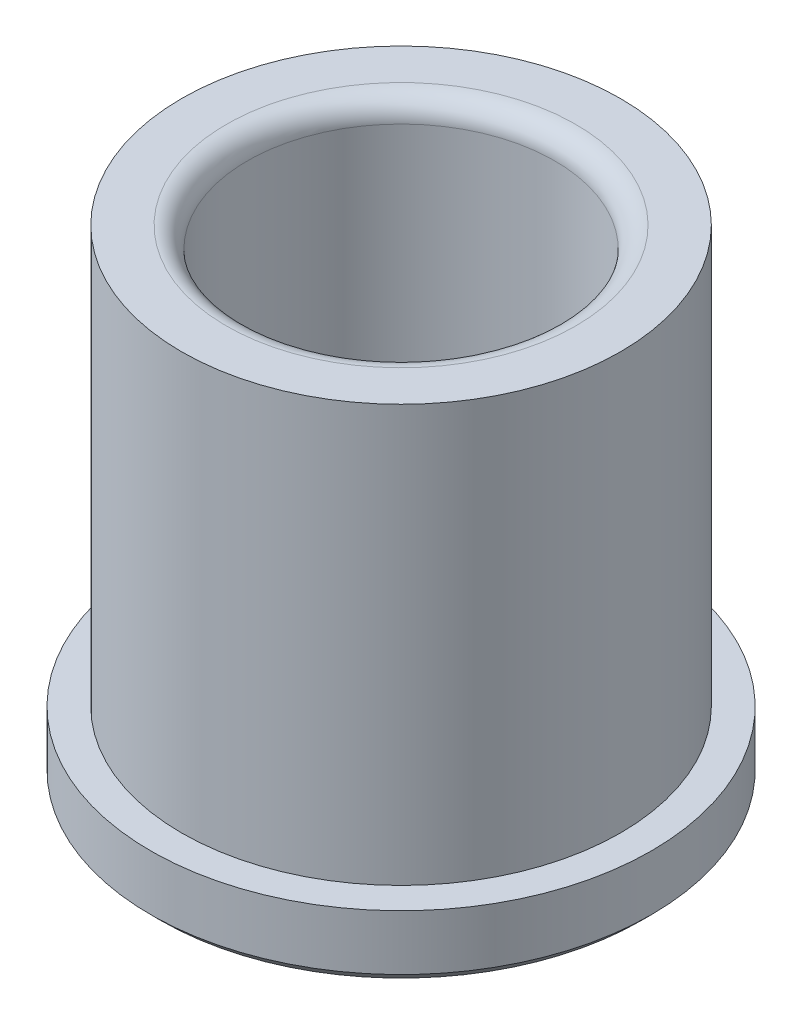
ISO-10303-21;
HEADER;
FILE_DESCRIPTION(('STEP AP214'),'2;1');
FILE_NAME('part.step','',(''),(''),'','','');
FILE_SCHEMA(('AUTOMOTIVE_DESIGN { 1 0 10303 214 1 1 1 1 }'));
ENDSEC;
DATA;
#1=APPLICATION_CONTEXT('core data for automotive mechanical design processes');
#2=APPLICATION_PROTOCOL_DEFINITION('international standard','automotive_design',2000,#1);
#3=PRODUCT_CONTEXT('',#1,'mechanical');
#4=PRODUCT('Part','Part','',(#3));
#5=PRODUCT_RELATED_PRODUCT_CATEGORY('part','',(#4));
#6=PRODUCT_DEFINITION_FORMATION('','',#4);
#7=PRODUCT_DEFINITION_CONTEXT('part definition',#1,'design');
#8=PRODUCT_DEFINITION('design','',#6,#7);
#9=PRODUCT_DEFINITION_SHAPE('','',#8);
#10=(LENGTH_UNIT() NAMED_UNIT(*) SI_UNIT(.MILLI.,.METRE.));
#11=(NAMED_UNIT(*) PLANE_ANGLE_UNIT() SI_UNIT($,.RADIAN.));
#12=(NAMED_UNIT(*) SI_UNIT($,.STERADIAN.) SOLID_ANGLE_UNIT());
#13=UNCERTAINTY_MEASURE_WITH_UNIT(LENGTH_MEASURE(1.E-05),#10,'distance_accuracy_value','');
#14=(GEOMETRIC_REPRESENTATION_CONTEXT(3) GLOBAL_UNCERTAINTY_ASSIGNED_CONTEXT((#13)) GLOBAL_UNIT_ASSIGNED_CONTEXT((#10,
#11,#12)) REPRESENTATION_CONTEXT('',''));
#15=CARTESIAN_POINT('',(0.,0.,0.));
#16=DIRECTION('',(0.,0.,1.));
#17=DIRECTION('',(1.,0.,0.));
#18=AXIS2_PLACEMENT_3D('',#15,#16,#17);
#19=CARTESIAN_POINT('',(3.49148336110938E-12,-1000.,0.));
#20=DIRECTION('',(0.,-1.,0.));
#21=DIRECTION('',(1.,0.,0.));
#22=AXIS2_PLACEMENT_3D('',#19,#20,#21);
#23=CYLINDRICAL_SURFACE('',#22,15.8813499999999);
#24=CARTESIAN_POINT('',(0.,4.7625,0.));
#25=DIRECTION('',(0.,-1.,0.));
#26=DIRECTION('',(1.,0.,0.));
#27=AXIS2_PLACEMENT_3D('',#24,#25,#26);
#28=CIRCLE('',#27,15.88135);
#29=CARTESIAN_POINT('',(15.8813499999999,4.76250000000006,0.));
#30=VERTEX_POINT('',#29);
#31=EDGE_CURVE('E60',#30,#30,#28,.T.);
#32=ORIENTED_EDGE('',*,*,#31,.F.);
#33=EDGE_LOOP('',(#32));
#34=FACE_BOUND('',#33,.T.);
#35=CARTESIAN_POINT('',(-1.21940056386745E-13,34.9250000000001,0.));
#36=DIRECTION('',(0.,-1.,0.));
#37=DIRECTION('',(1.,0.,0.));
#38=AXIS2_PLACEMENT_3D('',#35,#36,#37);
#39=CIRCLE('',#38,15.8813499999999);
#40=CARTESIAN_POINT('',(15.8813499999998,34.9250000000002,0.));
#41=VERTEX_POINT('',#40);
#42=EDGE_CURVE('E39',#41,#41,#39,.T.);
#43=ORIENTED_EDGE('',*,*,#42,.T.);
#44=EDGE_LOOP('',(#43));
#45=FACE_BOUND('',#44,.T.);
#46=ADVANCED_FACE('F28',(#34,#45),#23,.T.);
#47=CARTESIAN_POINT('',(-15.88135,34.925,0.));
#48=DIRECTION('',(0.,-1.,0.));
#49=DIRECTION('',(1.,0.,0.));
#50=AXIS2_PLACEMENT_3D('',#47,#48,#49);
#51=PLANE('',#50);
#52=CARTESIAN_POINT('',(-1.21940056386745E-13,34.925,0.));
#53=DIRECTION('',(0.,-1.,0.));
#54=DIRECTION('',(1.,0.,0.));
#55=AXIS2_PLACEMENT_3D('',#52,#53,#54);
#56=CIRCLE('',#55,12.6428499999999);
#57=CARTESIAN_POINT('',(12.6428499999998,34.9250000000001,0.));
#58=VERTEX_POINT('',#57);
#59=EDGE_CURVE('E35',#58,#58,#56,.T.);
#60=ORIENTED_EDGE('',*,*,#59,.T.);
#61=EDGE_LOOP('',(#60));
#62=FACE_BOUND('',#61,.T.);
#63=ORIENTED_EDGE('',*,*,#42,.F.);
#64=EDGE_LOOP('',(#63));
#65=FACE_BOUND('',#64,.T.);
#66=ADVANCED_FACE('F68',(#62,#65),#51,.F.);
#67=CARTESIAN_POINT('',(3.49148336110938E-12,-1000.,0.));
#68=DIRECTION('',(0.,-1.,0.));
#69=DIRECTION('',(1.,0.,0.));
#70=AXIS2_PLACEMENT_3D('',#67,#68,#69);
#71=CYLINDRICAL_SURFACE('',#70,11.1188499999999);
#72=CARTESIAN_POINT('',(-1.16619035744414E-13,33.401,0.));
#73=DIRECTION('',(0.,-1.,0.));
#74=DIRECTION('',(1.,0.,0.));
#75=AXIS2_PLACEMENT_3D('',#72,#73,#74);
#76=CIRCLE('',#75,11.1188499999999);
#77=CARTESIAN_POINT('',(11.1188499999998,33.4010000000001,0.));
#78=VERTEX_POINT('',#77);
#79=EDGE_CURVE('E10',#78,#78,#76,.F.);
#80=ORIENTED_EDGE('',*,*,#79,.T.);
#81=EDGE_LOOP('',(#80));
#82=FACE_BOUND('',#81,.T.);
#83=CARTESIAN_POINT('',(0.,0.761999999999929,0.));
#84=DIRECTION('',(0.,-1.,0.));
#85=DIRECTION('',(1.,0.,0.));
#86=AXIS2_PLACEMENT_3D('',#83,#84,#85);
#87=CIRCLE('',#86,11.11885);
#88=CARTESIAN_POINT('',(11.11885,0.761999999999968,0.));
#89=VERTEX_POINT('',#88);
#90=EDGE_CURVE('E43',#89,#89,#87,.T.);
#91=ORIENTED_EDGE('',*,*,#90,.T.);
#92=EDGE_LOOP('',(#91));
#93=FACE_BOUND('',#92,.T.);
#94=ADVANCED_FACE('F72',(#82,#93),#71,.F.);
#95=CARTESIAN_POINT('',(0.,0.,0.));
#96=DIRECTION('',(0.,-1.,0.));
#97=DIRECTION('',(1.,0.,0.));
#98=AXIS2_PLACEMENT_3D('',#95,#96,#97);
#99=CONICAL_SURFACE('',#98,11.88085,0.785398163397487);
#100=ORIENTED_EDGE('',*,*,#90,.F.);
#101=EDGE_LOOP('',(#100));
#102=FACE_BOUND('',#101,.T.);
#103=CARTESIAN_POINT('',(0.,0.,0.));
#104=DIRECTION('',(0.,-1.,0.));
#105=DIRECTION('',(1.,0.,0.));
#106=AXIS2_PLACEMENT_3D('',#103,#104,#105);
#107=CIRCLE('',#106,11.88085);
#108=CARTESIAN_POINT('',(11.88085,0.,0.));
#109=VERTEX_POINT('',#108);
#110=EDGE_CURVE('E48',#109,#109,#107,.T.);
#111=ORIENTED_EDGE('',*,*,#110,.T.);
#112=EDGE_LOOP('',(#111));
#113=FACE_BOUND('',#112,.T.);
#114=ADVANCED_FACE('F77',(#102,#113),#99,.F.);
#115=CARTESIAN_POINT('',(-11.88085,0.,0.));
#116=DIRECTION('',(0.,1.,0.));
#117=DIRECTION('',(-1.,0.,0.));
#118=AXIS2_PLACEMENT_3D('',#115,#116,#117);
#119=PLANE('',#118);
#120=ORIENTED_EDGE('',*,*,#110,.F.);
#121=EDGE_LOOP('',(#120));
#122=FACE_BOUND('',#121,.T.);
#123=CARTESIAN_POINT('',(0.,0.,0.));
#124=DIRECTION('',(0.,-1.,0.));
#125=DIRECTION('',(1.,0.,0.));
#126=AXIS2_PLACEMENT_3D('',#123,#124,#125);
#127=CIRCLE('',#126,17.3609);
#128=CARTESIAN_POINT('',(17.3609,0.,0.));
#129=VERTEX_POINT('',#128);
#130=EDGE_CURVE('E51',#129,#129,#127,.T.);
#131=ORIENTED_EDGE('',*,*,#130,.T.);
#132=EDGE_LOOP('',(#131));
#133=FACE_BOUND('',#132,.T.);
#134=ADVANCED_FACE('F82',(#122,#133),#119,.F.);
#135=CARTESIAN_POINT('',(0.,0.761999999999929,0.));
#136=DIRECTION('',(0.,1.,0.));
#137=DIRECTION('',(-1.,0.,0.));
#138=AXIS2_PLACEMENT_3D('',#135,#136,#137);
#139=CONICAL_SURFACE('',#138,18.1229,0.785398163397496);
#140=ORIENTED_EDGE('',*,*,#130,.F.);
#141=EDGE_LOOP('',(#140));
#142=FACE_BOUND('',#141,.T.);
#143=CARTESIAN_POINT('',(0.,0.761999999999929,0.));
#144=DIRECTION('',(0.,-1.,0.));
#145=DIRECTION('',(1.,0.,0.));
#146=AXIS2_PLACEMENT_3D('',#143,#144,#145);
#147=CIRCLE('',#146,18.1229);
#148=CARTESIAN_POINT('',(18.1229,0.761999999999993,0.));
#149=VERTEX_POINT('',#148);
#150=EDGE_CURVE('E54',#149,#149,#147,.T.);
#151=ORIENTED_EDGE('',*,*,#150,.T.);
#152=EDGE_LOOP('',(#151));
#153=FACE_BOUND('',#152,.T.);
#154=ADVANCED_FACE('F86',(#142,#153),#139,.T.);
#155=CARTESIAN_POINT('',(3.49148336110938E-12,-1000.,0.));
#156=DIRECTION('',(0.,-1.,0.));
#157=DIRECTION('',(1.,0.,0.));
#158=AXIS2_PLACEMENT_3D('',#155,#156,#157);
#159=CYLINDRICAL_SURFACE('',#158,18.1229);
#160=ORIENTED_EDGE('',*,*,#150,.F.);
#161=EDGE_LOOP('',(#160));
#162=FACE_BOUND('',#161,.T.);
#163=CARTESIAN_POINT('',(0.,4.7625,0.));
#164=DIRECTION('',(0.,-1.,0.));
#165=DIRECTION('',(1.,0.,0.));
#166=AXIS2_PLACEMENT_3D('',#163,#164,#165);
#167=CIRCLE('',#166,18.1229);
#168=CARTESIAN_POINT('',(18.1229,4.76250000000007,0.));
#169=VERTEX_POINT('',#168);
#170=EDGE_CURVE('E57',#169,#169,#167,.T.);
#171=ORIENTED_EDGE('',*,*,#170,.T.);
#172=EDGE_LOOP('',(#171));
#173=FACE_BOUND('',#172,.T.);
#174=ADVANCED_FACE('F90',(#162,#173),#159,.T.);
#175=CARTESIAN_POINT('',(-18.1229,4.76249999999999,0.));
#176=DIRECTION('',(0.,-1.,0.));
#177=DIRECTION('',(1.,0.,0.));
#178=AXIS2_PLACEMENT_3D('',#175,#176,#177);
#179=PLANE('',#178);
#180=ORIENTED_EDGE('',*,*,#170,.F.);
#181=EDGE_LOOP('',(#180));
#182=FACE_BOUND('',#181,.T.);
#183=ORIENTED_EDGE('',*,*,#31,.T.);
#184=EDGE_LOOP('',(#183));
#185=FACE_BOUND('',#184,.T.);
#186=ADVANCED_FACE('F64',(#182,#185),#179,.F.);
#187=CARTESIAN_POINT('',(-1.16619035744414E-13,33.401,0.));
#188=DIRECTION('',(0.,-1.,0.));
#189=DIRECTION('',(1.,0.,0.));
#190=AXIS2_PLACEMENT_3D('',#187,#188,#189);
#191=TOROIDAL_SURFACE('',#190,12.6428499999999,1.524);
#192=ORIENTED_EDGE('',*,*,#79,.F.);
#193=EDGE_LOOP('',(#192));
#194=FACE_BOUND('',#193,.T.);
#195=ORIENTED_EDGE('',*,*,#59,.F.);
#196=EDGE_LOOP('',(#195));
#197=FACE_BOUND('',#196,.T.);
#198=ADVANCED_FACE('F30',(#194,#197),#191,.T.);
#199=CLOSED_SHELL('',(#46,#66,#94,#114,#134,#154,#174,#186,#198));
#200=MANIFOLD_SOLID_BREP('B2',#199);
#201=ADVANCED_BREP_SHAPE_REPRESENTATION('',(#18,#200),#14);
#202=SHAPE_DEFINITION_REPRESENTATION(#9,#201);
ENDSEC;
END-ISO-10303-21;
